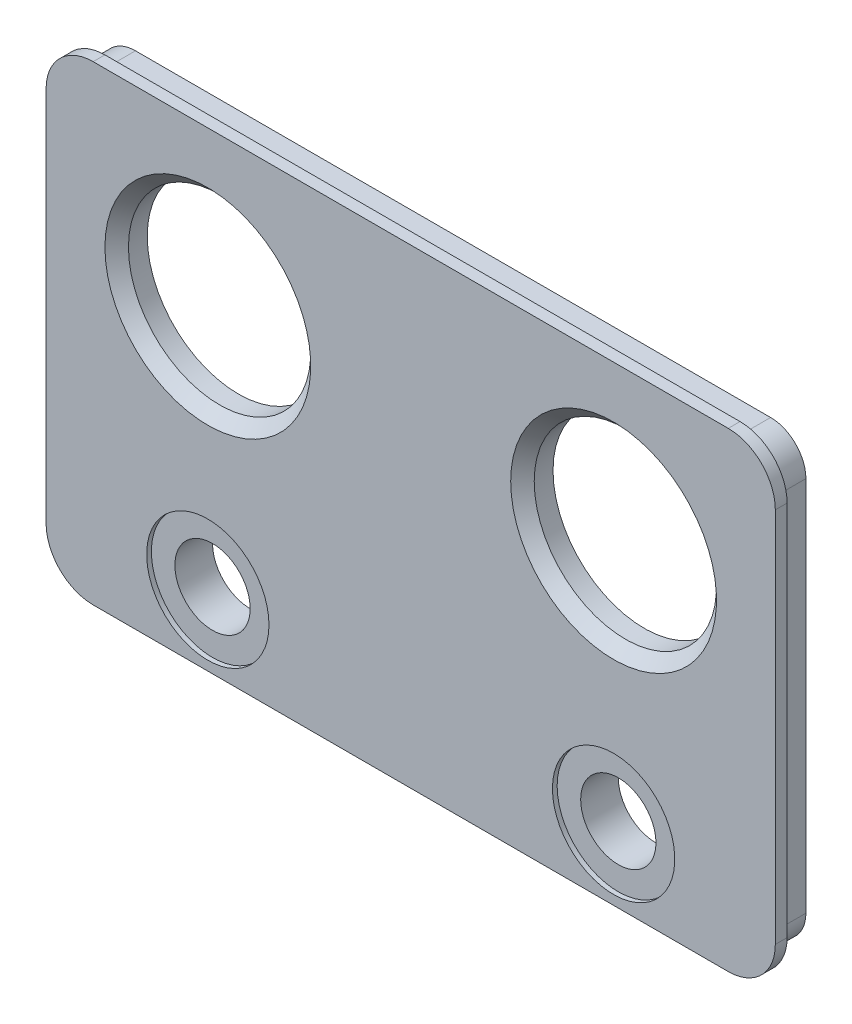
ISO-10303-21;
HEADER;
FILE_DESCRIPTION(('STEP AP214'),'2;1');
FILE_NAME('part.step','',(''),(''),'','','');
FILE_SCHEMA(('AUTOMOTIVE_DESIGN { 1 0 10303 214 1 1 1 1 }'));
ENDSEC;
DATA;
#1=APPLICATION_CONTEXT('core data for automotive mechanical design processes');
#2=APPLICATION_PROTOCOL_DEFINITION('international standard','automotive_design',2000,#1);
#3=PRODUCT_CONTEXT('',#1,'mechanical');
#4=PRODUCT('Part','Part','',(#3));
#5=PRODUCT_RELATED_PRODUCT_CATEGORY('part','',(#4));
#6=PRODUCT_DEFINITION_FORMATION('','',#4);
#7=PRODUCT_DEFINITION_CONTEXT('part definition',#1,'design');
#8=PRODUCT_DEFINITION('design','',#6,#7);
#9=PRODUCT_DEFINITION_SHAPE('','',#8);
#10=(LENGTH_UNIT() NAMED_UNIT(*) SI_UNIT(.MILLI.,.METRE.));
#11=(NAMED_UNIT(*) PLANE_ANGLE_UNIT() SI_UNIT($,.RADIAN.));
#12=(NAMED_UNIT(*) SI_UNIT($,.STERADIAN.) SOLID_ANGLE_UNIT());
#13=UNCERTAINTY_MEASURE_WITH_UNIT(LENGTH_MEASURE(1.E-05),#10,'distance_accuracy_value','');
#14=(GEOMETRIC_REPRESENTATION_CONTEXT(3) GLOBAL_UNCERTAINTY_ASSIGNED_CONTEXT((#13)) GLOBAL_UNIT_ASSIGNED_CONTEXT((#10,
#11,#12)) REPRESENTATION_CONTEXT('',''));
#15=CARTESIAN_POINT('',(0.,0.,0.));
#16=DIRECTION('',(0.,0.,1.));
#17=DIRECTION('',(1.,0.,0.));
#18=AXIS2_PLACEMENT_3D('',#15,#16,#17);
#19=CARTESIAN_POINT('',(135.,80.0000000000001,0.));
#20=DIRECTION('',(0.,0.,-1.));
#21=DIRECTION('',(-1.,0.,0.));
#22=AXIS2_PLACEMENT_3D('',#19,#20,#21);
#23=PLANE('',#22);
#24=CARTESIAN_POINT('',(-86.25,-70.,0.));
#25=DIRECTION('',(0.,0.,1.));
#26=DIRECTION('',(1.,0.,0.));
#27=AXIS2_PLACEMENT_3D('',#24,#25,#26);
#28=CIRCLE('',#27,16.);
#29=CARTESIAN_POINT('',(-70.25,-70.,0.));
#30=VERTEX_POINT('',#29);
#31=EDGE_CURVE('E492',#30,#30,#28,.T.);
#32=ORIENTED_EDGE('',*,*,#31,.T.);
#33=EDGE_LOOP('',(#32));
#34=FACE_BOUND('',#33,.T.);
#35=CARTESIAN_POINT('',(86.25,-70.,0.));
#36=DIRECTION('',(0.,0.,1.));
#37=DIRECTION('',(-1.,0.,0.));
#38=AXIS2_PLACEMENT_3D('',#35,#36,#37);
#39=CIRCLE('',#38,16.);
#40=CARTESIAN_POINT('',(70.25,-70.,0.));
#41=VERTEX_POINT('',#40);
#42=EDGE_CURVE('E479',#41,#41,#39,.T.);
#43=ORIENTED_EDGE('',*,*,#42,.T.);
#44=EDGE_LOOP('',(#43));
#45=FACE_BOUND('',#44,.T.);
#46=CARTESIAN_POINT('',(-122.678438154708,70.6784381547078,0.));
#47=DIRECTION('',(0.,0.,-1.));
#48=DIRECTION('',(1.,0.,0.));
#49=AXIS2_PLACEMENT_3D('',#46,#47,#48);
#50=CIRCLE('',#49,4.99999999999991);
#51=CARTESIAN_POINT('',(-127.583228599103,71.6495358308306,0.));
#52=VERTEX_POINT('',#51);
#53=CARTESIAN_POINT('',(-123.64953583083,75.5832285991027,0.));
#54=VERTEX_POINT('',#53);
#55=EDGE_CURVE('E372',#52,#54,#50,.T.);
#56=ORIENTED_EDGE('',*,*,#55,.F.);
#57=CARTESIAN_POINT('',(61.3132032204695,34.25,0.));
#58=DIRECTION('',(0.,0.,-1.));
#59=DIRECTION('',(1.,0.,0.));
#60=AXIS2_PLACEMENT_3D('',#57,#58,#59);
#61=CIRCLE('',#60,192.56320322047);
#62=CARTESIAN_POINT('',(-127.583228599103,-3.14953583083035,0.));
#63=VERTEX_POINT('',#62);
#64=EDGE_CURVE('E426',#63,#52,#61,.T.);
#65=ORIENTED_EDGE('',*,*,#64,.F.);
#66=CARTESIAN_POINT('',(-122.678438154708,-2.17843815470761,0.));
#67=DIRECTION('',(0.,0.,-1.));
#68=DIRECTION('',(1.,0.,0.));
#69=AXIS2_PLACEMENT_3D('',#66,#67,#68);
#70=CIRCLE('',#69,4.99999999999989);
#71=CARTESIAN_POINT('',(-123.649535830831,-7.08322859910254,0.));
#72=VERTEX_POINT('',#71);
#73=EDGE_CURVE('E429',#72,#63,#70,.T.);
#74=ORIENTED_EDGE('',*,*,#73,.F.);
#75=CARTESIAN_POINT('',(-86.25,181.81320322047,0.));
#76=DIRECTION('',(0.,0.,-1.));
#77=DIRECTION('',(1.,0.,0.));
#78=AXIS2_PLACEMENT_3D('',#75,#76,#77);
#79=CIRCLE('',#78,192.56320322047);
#80=CARTESIAN_POINT('',(-48.8504641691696,-7.08322859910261,0.));
#81=VERTEX_POINT('',#80);
#82=EDGE_CURVE('E433',#81,#72,#79,.T.);
#83=ORIENTED_EDGE('',*,*,#82,.F.);
#84=CARTESIAN_POINT('',(-49.8215618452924,-2.17843815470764,0.));
#85=DIRECTION('',(0.,0.,-1.));
#86=DIRECTION('',(1.,0.,0.));
#87=AXIS2_PLACEMENT_3D('',#84,#85,#86);
#88=CIRCLE('',#87,4.99999999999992);
#89=CARTESIAN_POINT('',(-44.9167714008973,-3.1495358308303,0.));
#90=VERTEX_POINT('',#89);
#91=EDGE_CURVE('E436',#90,#81,#88,.T.);
#92=ORIENTED_EDGE('',*,*,#91,.F.);
#93=CARTESIAN_POINT('',(-233.81320322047,34.2500000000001,0.));
#94=DIRECTION('',(0.,0.,-1.));
#95=DIRECTION('',(-1.,0.,0.));
#96=AXIS2_PLACEMENT_3D('',#93,#94,#95);
#97=CIRCLE('',#96,192.56320322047);
#98=CARTESIAN_POINT('',(-44.9167714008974,71.6495358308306,0.));
#99=VERTEX_POINT('',#98);
#100=EDGE_CURVE('E439',#99,#90,#97,.T.);
#101=ORIENTED_EDGE('',*,*,#100,.F.);
#102=CARTESIAN_POINT('',(-49.8215618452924,70.6784381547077,0.));
#103=DIRECTION('',(0.,0.,-1.));
#104=DIRECTION('',(-1.,0.,0.));
#105=AXIS2_PLACEMENT_3D('',#102,#103,#104);
#106=CIRCLE('',#105,4.99999999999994);
#107=CARTESIAN_POINT('',(-48.8504641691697,75.5832285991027,0.));
#108=VERTEX_POINT('',#107);
#109=EDGE_CURVE('E442',#108,#99,#106,.T.);
#110=ORIENTED_EDGE('',*,*,#109,.F.);
#111=CARTESIAN_POINT('',(-86.2500000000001,-113.31320322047,0.));
#112=DIRECTION('',(0.,0.,-1.));
#113=DIRECTION('',(-1.,0.,0.));
#114=AXIS2_PLACEMENT_3D('',#111,#112,#113);
#115=CIRCLE('',#114,192.56320322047);
#116=EDGE_CURVE('E445',#54,#108,#115,.T.);
#117=ORIENTED_EDGE('',*,*,#116,.F.);
#118=EDGE_LOOP('',(#56,#65,#74,#83,#92,#101,#110,#117));
#119=FACE_BOUND('',#118,.T.);
#120=CARTESIAN_POINT('',(49.8215618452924,-2.17843815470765,0.));
#121=DIRECTION('',(0.,0.,-1.));
#122=DIRECTION('',(-1.,0.,0.));
#123=AXIS2_PLACEMENT_3D('',#120,#121,#122);
#124=CIRCLE('',#123,4.99999999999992);
#125=CARTESIAN_POINT('',(48.8504641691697,-7.08322859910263,0.));
#126=VERTEX_POINT('',#125);
#127=CARTESIAN_POINT('',(44.9167714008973,-3.14953583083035,0.));
#128=VERTEX_POINT('',#127);
#129=EDGE_CURVE('E369',#126,#128,#124,.T.);
#130=ORIENTED_EDGE('',*,*,#129,.F.);
#131=CARTESIAN_POINT('',(86.25,181.81320322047,0.));
#132=DIRECTION('',(0.,0.,-1.));
#133=DIRECTION('',(-1.,0.,0.));
#134=AXIS2_PLACEMENT_3D('',#131,#132,#133);
#135=CIRCLE('',#134,192.56320322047);
#136=CARTESIAN_POINT('',(123.64953583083,-7.0832285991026,0.));
#137=VERTEX_POINT('',#136);
#138=EDGE_CURVE('E347',#137,#126,#135,.T.);
#139=ORIENTED_EDGE('',*,*,#138,.F.);
#140=CARTESIAN_POINT('',(122.678438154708,-2.17843815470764,0.));
#141=DIRECTION('',(0.,0.,-1.));
#142=DIRECTION('',(-1.,0.,0.));
#143=AXIS2_PLACEMENT_3D('',#140,#141,#142);
#144=CIRCLE('',#143,4.9999999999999);
#145=CARTESIAN_POINT('',(127.583228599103,-3.14953583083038,0.));
#146=VERTEX_POINT('',#145);
#147=EDGE_CURVE('E387',#146,#137,#144,.T.);
#148=ORIENTED_EDGE('',*,*,#147,.F.);
#149=CARTESIAN_POINT('',(-61.3132032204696,34.25,0.));
#150=DIRECTION('',(0.,0.,-1.));
#151=DIRECTION('',(-1.,0.,0.));
#152=AXIS2_PLACEMENT_3D('',#149,#150,#151);
#153=CIRCLE('',#152,192.56320322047);
#154=CARTESIAN_POINT('',(127.583228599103,71.6495358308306,0.));
#155=VERTEX_POINT('',#154);
#156=EDGE_CURVE('E384',#155,#146,#153,.T.);
#157=ORIENTED_EDGE('',*,*,#156,.F.);
#158=CARTESIAN_POINT('',(122.678438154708,70.6784381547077,0.));
#159=DIRECTION('',(0.,0.,-1.));
#160=DIRECTION('',(-1.,0.,0.));
#161=AXIS2_PLACEMENT_3D('',#158,#159,#160);
#162=CIRCLE('',#161,4.99999999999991);
#163=CARTESIAN_POINT('',(123.64953583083,75.5832285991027,0.));
#164=VERTEX_POINT('',#163);
#165=EDGE_CURVE('E381',#164,#155,#162,.T.);
#166=ORIENTED_EDGE('',*,*,#165,.F.);
#167=CARTESIAN_POINT('',(86.2500000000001,-113.31320322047,0.));
#168=DIRECTION('',(0.,0.,-1.));
#169=DIRECTION('',(1.,0.,0.));
#170=AXIS2_PLACEMENT_3D('',#167,#168,#169);
#171=CIRCLE('',#170,192.56320322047);
#172=CARTESIAN_POINT('',(48.8504641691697,75.5832285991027,0.));
#173=VERTEX_POINT('',#172);
#174=EDGE_CURVE('E378',#173,#164,#171,.T.);
#175=ORIENTED_EDGE('',*,*,#174,.F.);
#176=CARTESIAN_POINT('',(49.8215618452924,70.6784381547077,0.));
#177=DIRECTION('',(0.,0.,-1.));
#178=DIRECTION('',(1.,0.,0.));
#179=AXIS2_PLACEMENT_3D('',#176,#177,#178);
#180=CIRCLE('',#179,4.99999999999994);
#181=CARTESIAN_POINT('',(44.9167714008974,71.6495358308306,0.));
#182=VERTEX_POINT('',#181);
#183=EDGE_CURVE('E375',#182,#173,#180,.T.);
#184=ORIENTED_EDGE('',*,*,#183,.F.);
#185=CARTESIAN_POINT('',(233.81320322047,34.25,0.));
#186=DIRECTION('',(0.,0.,-1.));
#187=DIRECTION('',(1.,0.,0.));
#188=AXIS2_PLACEMENT_3D('',#185,#186,#187);
#189=CIRCLE('',#188,192.56320322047);
#190=EDGE_CURVE('E371',#128,#182,#189,.T.);
#191=ORIENTED_EDGE('',*,*,#190,.F.);
#192=EDGE_LOOP('',(#130,#139,#148,#157,#166,#175,#184,#191));
#193=FACE_BOUND('',#192,.T.);
#194=DIRECTION('',(1.,0.,0.));
#195=VECTOR('',#194,1.);
#196=CARTESIAN_POINT('',(-135.,95.,0.));
#197=LINE('',#196,#195);
#198=CARTESIAN_POINT('',(-135.,95.,0.));
#199=VERTEX_POINT('',#198);
#200=CARTESIAN_POINT('',(135.,95.0000000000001,0.));
#201=VERTEX_POINT('',#200);
#202=EDGE_CURVE('E280',#199,#201,#197,.T.);
#203=ORIENTED_EDGE('',*,*,#202,.T.);
#204=CARTESIAN_POINT('',(135.,80.0000000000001,0.));
#205=DIRECTION('',(0.,0.,-1.));
#206=DIRECTION('',(-1.,0.,0.));
#207=AXIS2_PLACEMENT_3D('',#204,#205,#206);
#208=CIRCLE('',#207,15.);
#209=CARTESIAN_POINT('',(150.,80.0000000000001,0.));
#210=VERTEX_POINT('',#209);
#211=EDGE_CURVE('E300',#201,#210,#208,.T.);
#212=ORIENTED_EDGE('',*,*,#211,.T.);
#213=DIRECTION('',(0.,-1.,0.));
#214=VECTOR('',#213,1.);
#215=CARTESIAN_POINT('',(150.,80.0000000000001,0.));
#216=LINE('',#215,#214);
#217=CARTESIAN_POINT('',(150.,-79.9999999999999,0.));
#218=VERTEX_POINT('',#217);
#219=EDGE_CURVE('E260',#210,#218,#216,.T.);
#220=ORIENTED_EDGE('',*,*,#219,.T.);
#221=CARTESIAN_POINT('',(135.,-79.9999999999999,0.));
#222=DIRECTION('',(0.,0.,-1.));
#223=DIRECTION('',(-1.,0.,0.));
#224=AXIS2_PLACEMENT_3D('',#221,#222,#223);
#225=CIRCLE('',#224,15.);
#226=CARTESIAN_POINT('',(135.,-94.9999999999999,0.));
#227=VERTEX_POINT('',#226);
#228=EDGE_CURVE('E60',#218,#227,#225,.T.);
#229=ORIENTED_EDGE('',*,*,#228,.T.);
#230=DIRECTION('',(-1.,0.,0.));
#231=VECTOR('',#230,1.);
#232=CARTESIAN_POINT('',(135.,-94.9999999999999,0.));
#233=LINE('',#232,#231);
#234=CARTESIAN_POINT('',(-135.,-94.9999999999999,0.));
#235=VERTEX_POINT('',#234);
#236=EDGE_CURVE('E304',#227,#235,#233,.T.);
#237=ORIENTED_EDGE('',*,*,#236,.T.);
#238=CARTESIAN_POINT('',(-135.,-80.,0.));
#239=DIRECTION('',(0.,0.,-1.));
#240=DIRECTION('',(-1.,0.,0.));
#241=AXIS2_PLACEMENT_3D('',#238,#239,#240);
#242=CIRCLE('',#241,15.);
#243=CARTESIAN_POINT('',(-150.,-80.,0.));
#244=VERTEX_POINT('',#243);
#245=EDGE_CURVE('E307',#235,#244,#242,.T.);
#246=ORIENTED_EDGE('',*,*,#245,.T.);
#247=DIRECTION('',(0.,1.,0.));
#248=VECTOR('',#247,1.);
#249=CARTESIAN_POINT('',(-150.,-80.,0.));
#250=LINE('',#249,#248);
#251=CARTESIAN_POINT('',(-150.,80.,0.));
#252=VERTEX_POINT('',#251);
#253=EDGE_CURVE('E310',#244,#252,#250,.T.);
#254=ORIENTED_EDGE('',*,*,#253,.T.);
#255=CARTESIAN_POINT('',(-135.,80.,0.));
#256=DIRECTION('',(0.,0.,-1.));
#257=DIRECTION('',(-1.,0.,0.));
#258=AXIS2_PLACEMENT_3D('',#255,#256,#257);
#259=CIRCLE('',#258,15.);
#260=EDGE_CURVE('E283',#252,#199,#259,.T.);
#261=ORIENTED_EDGE('',*,*,#260,.T.);
#262=EDGE_LOOP('',(#203,#212,#220,#229,#237,#246,#254,#261));
#263=FACE_BOUND('',#262,.T.);
#264=ADVANCED_FACE('F42',(#34,#45,#119,#193,#263),#23,.T.);
#265=CARTESIAN_POINT('',(135.,80.0000000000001,18.));
#266=DIRECTION('',(0.,0.,-1.));
#267=DIRECTION('',(-1.,0.,0.));
#268=AXIS2_PLACEMENT_3D('',#265,#266,#267);
#269=CYLINDRICAL_SURFACE('',#268,20.);
#270=CARTESIAN_POINT('',(135.,80.0000000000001,13.));
#271=DIRECTION('',(0.,0.,-1.));
#272=DIRECTION('',(-1.,0.,0.));
#273=AXIS2_PLACEMENT_3D('',#270,#271,#272);
#274=CIRCLE('',#273,20.);
#275=CARTESIAN_POINT('',(135.,100.,13.));
#276=VERTEX_POINT('',#275);
#277=CARTESIAN_POINT('',(155.,80.0000000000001,13.));
#278=VERTEX_POINT('',#277);
#279=EDGE_CURVE('E68',#276,#278,#274,.T.);
#280=ORIENTED_EDGE('',*,*,#279,.F.);
#281=DIRECTION('',(0.,0.,-1.));
#282=VECTOR('',#281,1.);
#283=CARTESIAN_POINT('',(135.,100.,18.));
#284=LINE('',#283,#282);
#285=CARTESIAN_POINT('',(135.,100.,18.));
#286=VERTEX_POINT('',#285);
#287=EDGE_CURVE('E533',#286,#276,#284,.T.);
#288=ORIENTED_EDGE('',*,*,#287,.F.);
#289=CARTESIAN_POINT('',(135.,80.0000000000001,18.));
#290=DIRECTION('',(0.,0.,1.));
#291=DIRECTION('',(-1.,0.,0.));
#292=AXIS2_PLACEMENT_3D('',#289,#290,#291);
#293=CIRCLE('',#292,20.);
#294=CARTESIAN_POINT('',(155.,80.0000000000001,18.));
#295=VERTEX_POINT('',#294);
#296=EDGE_CURVE('E495',#295,#286,#293,.T.);
#297=ORIENTED_EDGE('',*,*,#296,.F.);
#298=DIRECTION('',(0.,0.,-1.));
#299=VECTOR('',#298,1.);
#300=CARTESIAN_POINT('',(155.,80.0000000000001,18.));
#301=LINE('',#300,#299);
#302=EDGE_CURVE('E512',#295,#278,#301,.T.);
#303=ORIENTED_EDGE('',*,*,#302,.T.);
#304=EDGE_LOOP('',(#280,#288,#297,#303));
#305=FACE_BOUND('',#304,.T.);
#306=ADVANCED_FACE('F575',(#305),#269,.T.);
#307=CARTESIAN_POINT('',(-135.,100.,18.));
#308=DIRECTION('',(0.,-1.,0.));
#309=DIRECTION('',(1.,0.,0.));
#310=AXIS2_PLACEMENT_3D('',#307,#308,#309);
#311=PLANE('',#310);
#312=DIRECTION('',(1.,0.,0.));
#313=VECTOR('',#312,1.);
#314=CARTESIAN_POINT('',(-135.,100.,13.));
#315=LINE('',#314,#313);
#316=CARTESIAN_POINT('',(-135.,100.,13.));
#317=VERTEX_POINT('',#316);
#318=EDGE_CURVE('E340',#317,#276,#315,.T.);
#319=ORIENTED_EDGE('',*,*,#318,.F.);
#320=DIRECTION('',(0.,0.,-1.));
#321=VECTOR('',#320,1.);
#322=CARTESIAN_POINT('',(-135.,100.,18.));
#323=LINE('',#322,#321);
#324=CARTESIAN_POINT('',(-135.,100.,18.));
#325=VERTEX_POINT('',#324);
#326=EDGE_CURVE('E530',#325,#317,#323,.T.);
#327=ORIENTED_EDGE('',*,*,#326,.F.);
#328=DIRECTION('',(-1.,0.,0.));
#329=VECTOR('',#328,1.);
#330=CARTESIAN_POINT('',(-135.,100.,18.));
#331=LINE('',#330,#329);
#332=EDGE_CURVE('E498',#286,#325,#331,.T.);
#333=ORIENTED_EDGE('',*,*,#332,.F.);
#334=ORIENTED_EDGE('',*,*,#287,.T.);
#335=EDGE_LOOP('',(#319,#327,#333,#334));
#336=FACE_BOUND('',#335,.T.);
#337=ADVANCED_FACE('F581',(#336),#311,.F.);
#338=CARTESIAN_POINT('',(-135.,80.,18.));
#339=DIRECTION('',(0.,0.,-1.));
#340=DIRECTION('',(-1.,0.,0.));
#341=AXIS2_PLACEMENT_3D('',#338,#339,#340);
#342=CYLINDRICAL_SURFACE('',#341,20.);
#343=CARTESIAN_POINT('',(-135.,80.,13.));
#344=DIRECTION('',(0.,0.,-1.));
#345=DIRECTION('',(-1.,0.,0.));
#346=AXIS2_PLACEMENT_3D('',#343,#344,#345);
#347=CIRCLE('',#346,20.);
#348=CARTESIAN_POINT('',(-155.,80.,13.));
#349=VERTEX_POINT('',#348);
#350=EDGE_CURVE('E338',#349,#317,#347,.T.);
#351=ORIENTED_EDGE('',*,*,#350,.F.);
#352=DIRECTION('',(0.,0.,-1.));
#353=VECTOR('',#352,1.);
#354=CARTESIAN_POINT('',(-155.,80.,18.));
#355=LINE('',#354,#353);
#356=CARTESIAN_POINT('',(-155.,80.,18.));
#357=VERTEX_POINT('',#356);
#358=EDGE_CURVE('E527',#357,#349,#355,.T.);
#359=ORIENTED_EDGE('',*,*,#358,.F.);
#360=CARTESIAN_POINT('',(-135.,80.,18.));
#361=DIRECTION('',(0.,0.,1.));
#362=DIRECTION('',(-1.,0.,0.));
#363=AXIS2_PLACEMENT_3D('',#360,#361,#362);
#364=CIRCLE('',#363,20.);
#365=EDGE_CURVE('E500',#325,#357,#364,.T.);
#366=ORIENTED_EDGE('',*,*,#365,.F.);
#367=ORIENTED_EDGE('',*,*,#326,.T.);
#368=EDGE_LOOP('',(#351,#359,#366,#367));
#369=FACE_BOUND('',#368,.T.);
#370=ADVANCED_FACE('F608',(#369),#342,.T.);
#371=CARTESIAN_POINT('',(-155.,-80.,18.));
#372=DIRECTION('',(1.,0.,0.));
#373=DIRECTION('',(0.,1.,0.));
#374=AXIS2_PLACEMENT_3D('',#371,#372,#373);
#375=PLANE('',#374);
#376=DIRECTION('',(0.,1.,0.));
#377=VECTOR('',#376,1.);
#378=CARTESIAN_POINT('',(-155.,-80.,13.));
#379=LINE('',#378,#377);
#380=CARTESIAN_POINT('',(-155.,-80.,13.));
#381=VERTEX_POINT('',#380);
#382=EDGE_CURVE('E336',#381,#349,#379,.T.);
#383=ORIENTED_EDGE('',*,*,#382,.F.);
#384=DIRECTION('',(0.,0.,-1.));
#385=VECTOR('',#384,1.);
#386=CARTESIAN_POINT('',(-155.,-80.,18.));
#387=LINE('',#386,#385);
#388=CARTESIAN_POINT('',(-155.,-80.,18.));
#389=VERTEX_POINT('',#388);
#390=EDGE_CURVE('E524',#389,#381,#387,.T.);
#391=ORIENTED_EDGE('',*,*,#390,.F.);
#392=DIRECTION('',(0.,-1.,0.));
#393=VECTOR('',#392,1.);
#394=CARTESIAN_POINT('',(-155.,-80.,18.));
#395=LINE('',#394,#393);
#396=EDGE_CURVE('E502',#357,#389,#395,.T.);
#397=ORIENTED_EDGE('',*,*,#396,.F.);
#398=ORIENTED_EDGE('',*,*,#358,.T.);
#399=EDGE_LOOP('',(#383,#391,#397,#398));
#400=FACE_BOUND('',#399,.T.);
#401=ADVANCED_FACE('F604',(#400),#375,.F.);
#402=CARTESIAN_POINT('',(-135.,-80.,18.));
#403=DIRECTION('',(0.,0.,-1.));
#404=DIRECTION('',(-1.,0.,0.));
#405=AXIS2_PLACEMENT_3D('',#402,#403,#404);
#406=CYLINDRICAL_SURFACE('',#405,20.);
#407=CARTESIAN_POINT('',(-135.,-80.,13.));
#408=DIRECTION('',(0.,0.,-1.));
#409=DIRECTION('',(-1.,0.,0.));
#410=AXIS2_PLACEMENT_3D('',#407,#408,#409);
#411=CIRCLE('',#410,20.);
#412=CARTESIAN_POINT('',(-135.,-99.9999999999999,13.));
#413=VERTEX_POINT('',#412);
#414=EDGE_CURVE('E334',#413,#381,#411,.T.);
#415=ORIENTED_EDGE('',*,*,#414,.F.);
#416=DIRECTION('',(0.,0.,-1.));
#417=VECTOR('',#416,1.);
#418=CARTESIAN_POINT('',(-135.,-99.9999999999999,18.));
#419=LINE('',#418,#417);
#420=CARTESIAN_POINT('',(-135.,-99.9999999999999,18.));
#421=VERTEX_POINT('',#420);
#422=EDGE_CURVE('E521',#421,#413,#419,.T.);
#423=ORIENTED_EDGE('',*,*,#422,.F.);
#424=CARTESIAN_POINT('',(-135.,-80.,18.));
#425=DIRECTION('',(0.,0.,1.));
#426=DIRECTION('',(-1.,0.,0.));
#427=AXIS2_PLACEMENT_3D('',#424,#425,#426);
#428=CIRCLE('',#427,20.);
#429=EDGE_CURVE('E504',#389,#421,#428,.T.);
#430=ORIENTED_EDGE('',*,*,#429,.F.);
#431=ORIENTED_EDGE('',*,*,#390,.T.);
#432=EDGE_LOOP('',(#415,#423,#430,#431));
#433=FACE_BOUND('',#432,.T.);
#434=ADVANCED_FACE('F600',(#433),#406,.T.);
#435=CARTESIAN_POINT('',(-135.,-100.,18.));
#436=DIRECTION('',(0.,1.,0.));
#437=DIRECTION('',(-1.,0.,0.));
#438=AXIS2_PLACEMENT_3D('',#435,#436,#437);
#439=PLANE('',#438);
#440=DIRECTION('',(-1.,0.,0.));
#441=VECTOR('',#440,1.);
#442=CARTESIAN_POINT('',(135.,-99.9999999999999,13.));
#443=LINE('',#442,#441);
#444=CARTESIAN_POINT('',(135.,-99.9999999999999,13.));
#445=VERTEX_POINT('',#444);
#446=EDGE_CURVE('E332',#445,#413,#443,.T.);
#447=ORIENTED_EDGE('',*,*,#446,.F.);
#448=DIRECTION('',(0.,0.,-1.));
#449=VECTOR('',#448,1.);
#450=CARTESIAN_POINT('',(135.,-99.9999999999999,18.));
#451=LINE('',#450,#449);
#452=CARTESIAN_POINT('',(135.,-99.9999999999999,18.));
#453=VERTEX_POINT('',#452);
#454=EDGE_CURVE('E518',#453,#445,#451,.T.);
#455=ORIENTED_EDGE('',*,*,#454,.F.);
#456=DIRECTION('',(1.,0.,0.));
#457=VECTOR('',#456,1.);
#458=CARTESIAN_POINT('',(-135.,-100.,18.));
#459=LINE('',#458,#457);
#460=EDGE_CURVE('E506',#421,#453,#459,.T.);
#461=ORIENTED_EDGE('',*,*,#460,.F.);
#462=ORIENTED_EDGE('',*,*,#422,.T.);
#463=EDGE_LOOP('',(#447,#455,#461,#462));
#464=FACE_BOUND('',#463,.T.);
#465=ADVANCED_FACE('F596',(#464),#439,.F.);
#466=CARTESIAN_POINT('',(135.,-79.9999999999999,18.));
#467=DIRECTION('',(0.,0.,-1.));
#468=DIRECTION('',(-1.,0.,0.));
#469=AXIS2_PLACEMENT_3D('',#466,#467,#468);
#470=CYLINDRICAL_SURFACE('',#469,20.);
#471=CARTESIAN_POINT('',(135.,-79.9999999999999,13.));
#472=DIRECTION('',(0.,0.,-1.));
#473=DIRECTION('',(-1.,0.,0.));
#474=AXIS2_PLACEMENT_3D('',#471,#472,#473);
#475=CIRCLE('',#474,20.);
#476=CARTESIAN_POINT('',(155.,-79.9999999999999,13.));
#477=VERTEX_POINT('',#476);
#478=EDGE_CURVE('E330',#477,#445,#475,.T.);
#479=ORIENTED_EDGE('',*,*,#478,.F.);
#480=DIRECTION('',(0.,0.,-1.));
#481=VECTOR('',#480,1.);
#482=CARTESIAN_POINT('',(155.,-79.9999999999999,18.));
#483=LINE('',#482,#481);
#484=CARTESIAN_POINT('',(155.,-79.9999999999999,18.));
#485=VERTEX_POINT('',#484);
#486=EDGE_CURVE('E515',#485,#477,#483,.T.);
#487=ORIENTED_EDGE('',*,*,#486,.F.);
#488=CARTESIAN_POINT('',(135.,-79.9999999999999,18.));
#489=DIRECTION('',(0.,0.,1.));
#490=DIRECTION('',(1.,0.,0.));
#491=AXIS2_PLACEMENT_3D('',#488,#489,#490);
#492=CIRCLE('',#491,20.);
#493=EDGE_CURVE('E508',#453,#485,#492,.T.);
#494=ORIENTED_EDGE('',*,*,#493,.F.);
#495=ORIENTED_EDGE('',*,*,#454,.T.);
#496=EDGE_LOOP('',(#479,#487,#494,#495));
#497=FACE_BOUND('',#496,.T.);
#498=ADVANCED_FACE('F592',(#497),#470,.T.);
#499=CARTESIAN_POINT('',(155.,-79.9999999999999,18.));
#500=DIRECTION('',(-1.,0.,0.));
#501=DIRECTION('',(0.,0.,1.));
#502=AXIS2_PLACEMENT_3D('',#499,#500,#501);
#503=PLANE('',#502);
#504=DIRECTION('',(0.,-1.,0.));
#505=VECTOR('',#504,1.);
#506=CARTESIAN_POINT('',(155.,80.0000000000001,13.));
#507=LINE('',#506,#505);
#508=EDGE_CURVE('E328',#278,#477,#507,.T.);
#509=ORIENTED_EDGE('',*,*,#508,.F.);
#510=ORIENTED_EDGE('',*,*,#302,.F.);
#511=DIRECTION('',(0.,1.,0.));
#512=VECTOR('',#511,1.);
#513=CARTESIAN_POINT('',(155.,-79.9999999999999,18.));
#514=LINE('',#513,#512);
#515=EDGE_CURVE('E510',#485,#295,#514,.T.);
#516=ORIENTED_EDGE('',*,*,#515,.F.);
#517=ORIENTED_EDGE('',*,*,#486,.T.);
#518=EDGE_LOOP('',(#509,#510,#516,#517));
#519=FACE_BOUND('',#518,.T.);
#520=ADVANCED_FACE('F588',(#519),#503,.F.);
#521=CARTESIAN_POINT('',(86.25,34.25,18.));
#522=DIRECTION('',(0.,0.,-1.));
#523=DIRECTION('',(-1.,0.,0.));
#524=AXIS2_PLACEMENT_3D('',#521,#522,#523);
#525=CYLINDRICAL_SURFACE('',#524,38.75);
#526=CARTESIAN_POINT('',(86.25,34.25,13.));
#527=DIRECTION('',(0.,0.,-1.));
#528=DIRECTION('',(-1.,0.,0.));
#529=AXIS2_PLACEMENT_3D('',#526,#527,#528);
#530=CIRCLE('',#529,38.75);
#531=CARTESIAN_POINT('',(47.5,34.25,13.));
#532=VERTEX_POINT('',#531);
#533=EDGE_CURVE('E536',#532,#532,#530,.F.);
#534=ORIENTED_EDGE('',*,*,#533,.T.);
#535=EDGE_LOOP('',(#534));
#536=FACE_BOUND('',#535,.T.);
#537=CARTESIAN_POINT('',(86.25,34.25,5.));
#538=DIRECTION('',(0.,0.,-1.));
#539=DIRECTION('',(-1.,0.,0.));
#540=AXIS2_PLACEMENT_3D('',#537,#538,#539);
#541=CIRCLE('',#540,38.75);
#542=CARTESIAN_POINT('',(47.5,34.25,5.));
#543=VERTEX_POINT('',#542);
#544=EDGE_CURVE('E394',#543,#543,#541,.T.);
#545=ORIENTED_EDGE('',*,*,#544,.T.);
#546=EDGE_LOOP('',(#545));
#547=FACE_BOUND('',#546,.T.);
#548=ADVANCED_FACE('F591',(#536,#547),#525,.F.);
#549=CARTESIAN_POINT('',(-86.25,-70.,18.));
#550=DIRECTION('',(0.,0.,-1.));
#551=DIRECTION('',(-1.,0.,0.));
#552=AXIS2_PLACEMENT_3D('',#549,#550,#551);
#553=CYLINDRICAL_SURFACE('',#552,16.);
#554=ORIENTED_EDGE('',*,*,#31,.F.);
#555=EDGE_LOOP('',(#554));
#556=FACE_BOUND('',#555,.T.);
#557=CARTESIAN_POINT('',(-86.25,-70.,16.));
#558=DIRECTION('',(0.,0.,1.));
#559=DIRECTION('',(1.,0.,0.));
#560=AXIS2_PLACEMENT_3D('',#557,#558,#559);
#561=CIRCLE('',#560,16.);
#562=CARTESIAN_POINT('',(-70.25,-70.,16.));
#563=VERTEX_POINT('',#562);
#564=EDGE_CURVE('E471',#563,#563,#561,.T.);
#565=ORIENTED_EDGE('',*,*,#564,.T.);
#566=EDGE_LOOP('',(#565));
#567=FACE_BOUND('',#566,.T.);
#568=ADVANCED_FACE('F735',(#556,#567),#553,.F.);
#569=CARTESIAN_POINT('',(135.,80.0000000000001,18.));
#570=DIRECTION('',(0.,0.,-1.));
#571=DIRECTION('',(-1.,0.,0.));
#572=AXIS2_PLACEMENT_3D('',#569,#570,#571);
#573=PLANE('',#572);
#574=CARTESIAN_POINT('',(86.25,34.25,18.));
#575=DIRECTION('',(0.,0.,-1.));
#576=DIRECTION('',(-1.,0.,0.));
#577=AXIS2_PLACEMENT_3D('',#574,#575,#576);
#578=CIRCLE('',#577,43.75);
#579=CARTESIAN_POINT('',(42.5,34.25,18.));
#580=VERTEX_POINT('',#579);
#581=EDGE_CURVE('E52',#580,#580,#578,.T.);
#582=ORIENTED_EDGE('',*,*,#581,.T.);
#583=EDGE_LOOP('',(#582));
#584=FACE_BOUND('',#583,.T.);
#585=CARTESIAN_POINT('',(-86.25,34.25,18.));
#586=DIRECTION('',(0.,0.,-1.));
#587=DIRECTION('',(-1.,0.,0.));
#588=AXIS2_PLACEMENT_3D('',#585,#586,#587);
#589=CIRCLE('',#588,43.75);
#590=CARTESIAN_POINT('',(-130.,34.25,18.));
#591=VERTEX_POINT('',#590);
#592=EDGE_CURVE('E539',#591,#591,#589,.T.);
#593=ORIENTED_EDGE('',*,*,#592,.T.);
#594=EDGE_LOOP('',(#593));
#595=FACE_BOUND('',#594,.T.);
#596=CARTESIAN_POINT('',(-86.25,-70.,18.));
#597=DIRECTION('',(0.,0.,1.));
#598=DIRECTION('',(1.,0.,0.));
#599=AXIS2_PLACEMENT_3D('',#596,#597,#598);
#600=CIRCLE('',#599,26.);
#601=CARTESIAN_POINT('',(-60.25,-70.,18.));
#602=VERTEX_POINT('',#601);
#603=EDGE_CURVE('E474',#602,#602,#600,.T.);
#604=ORIENTED_EDGE('',*,*,#603,.F.);
#605=EDGE_LOOP('',(#604));
#606=FACE_BOUND('',#605,.T.);
#607=CARTESIAN_POINT('',(86.25,-70.,18.));
#608=DIRECTION('',(0.,0.,1.));
#609=DIRECTION('',(-1.,0.,0.));
#610=AXIS2_PLACEMENT_3D('',#607,#608,#609);
#611=CIRCLE('',#610,26.);
#612=CARTESIAN_POINT('',(60.25,-70.,18.));
#613=VERTEX_POINT('',#612);
#614=EDGE_CURVE('E482',#613,#613,#611,.T.);
#615=ORIENTED_EDGE('',*,*,#614,.F.);
#616=EDGE_LOOP('',(#615));
#617=FACE_BOUND('',#616,.T.);
#618=ORIENTED_EDGE('',*,*,#296,.T.);
#619=ORIENTED_EDGE('',*,*,#332,.T.);
#620=ORIENTED_EDGE('',*,*,#365,.T.);
#621=ORIENTED_EDGE('',*,*,#396,.T.);
#622=ORIENTED_EDGE('',*,*,#429,.T.);
#623=ORIENTED_EDGE('',*,*,#460,.T.);
#624=ORIENTED_EDGE('',*,*,#493,.T.);
#625=ORIENTED_EDGE('',*,*,#515,.T.);
#626=EDGE_LOOP('',(#618,#619,#620,#621,#622,#623,#624,#625));
#627=FACE_BOUND('',#626,.T.);
#628=ADVANCED_FACE('F556',(#584,#595,#606,#617,#627),#573,.F.);
#629=CARTESIAN_POINT('',(-86.25,34.25,18.));
#630=DIRECTION('',(0.,0.,-1.));
#631=DIRECTION('',(-1.,0.,0.));
#632=AXIS2_PLACEMENT_3D('',#629,#630,#631);
#633=CYLINDRICAL_SURFACE('',#632,38.75);
#634=CARTESIAN_POINT('',(-86.25,34.25,5.));
#635=DIRECTION('',(0.,0.,1.));
#636=DIRECTION('',(1.,0.,0.));
#637=AXIS2_PLACEMENT_3D('',#634,#635,#636);
#638=CIRCLE('',#637,38.75);
#639=CARTESIAN_POINT('',(-47.5,34.25,5.));
#640=VERTEX_POINT('',#639);
#641=EDGE_CURVE('E47',#640,#640,#638,.T.);
#642=ORIENTED_EDGE('',*,*,#641,.F.);
#643=EDGE_LOOP('',(#642));
#644=FACE_BOUND('',#643,.T.);
#645=CARTESIAN_POINT('',(-86.25,34.25,13.));
#646=DIRECTION('',(0.,0.,-1.));
#647=DIRECTION('',(-1.,0.,0.));
#648=AXIS2_PLACEMENT_3D('',#645,#646,#647);
#649=CIRCLE('',#648,38.75);
#650=CARTESIAN_POINT('',(-125.,34.25,13.));
#651=VERTEX_POINT('',#650);
#652=EDGE_CURVE('E11',#651,#651,#649,.F.);
#653=ORIENTED_EDGE('',*,*,#652,.T.);
#654=EDGE_LOOP('',(#653));
#655=FACE_BOUND('',#654,.T.);
#656=ADVANCED_FACE('F552',(#644,#655),#633,.F.);
#657=CARTESIAN_POINT('',(86.25,-70.,18.));
#658=DIRECTION('',(0.,0.,-1.));
#659=DIRECTION('',(-1.,0.,0.));
#660=AXIS2_PLACEMENT_3D('',#657,#658,#659);
#661=CYLINDRICAL_SURFACE('',#660,16.);
#662=CARTESIAN_POINT('',(86.25,-70.,16.));
#663=DIRECTION('',(0.,0.,1.));
#664=DIRECTION('',(-1.,0.,0.));
#665=AXIS2_PLACEMENT_3D('',#662,#663,#664);
#666=CIRCLE('',#665,16.);
#667=CARTESIAN_POINT('',(70.25,-70.,16.));
#668=VERTEX_POINT('',#667);
#669=EDGE_CURVE('E475',#668,#668,#666,.T.);
#670=ORIENTED_EDGE('',*,*,#669,.T.);
#671=EDGE_LOOP('',(#670));
#672=FACE_BOUND('',#671,.T.);
#673=ORIENTED_EDGE('',*,*,#42,.F.);
#674=EDGE_LOOP('',(#673));
#675=FACE_BOUND('',#674,.T.);
#676=ADVANCED_FACE('F555',(#672,#675),#661,.F.);
#677=CARTESIAN_POINT('',(86.25,-70.,16.));
#678=DIRECTION('',(0.,0.,1.));
#679=DIRECTION('',(1.,0.,0.));
#680=AXIS2_PLACEMENT_3D('',#677,#678,#679);
#681=CYLINDRICAL_SURFACE('',#680,26.);
#682=CARTESIAN_POINT('',(86.25,-70.,16.));
#683=DIRECTION('',(0.,0.,1.));
#684=DIRECTION('',(-1.,0.,0.));
#685=AXIS2_PLACEMENT_3D('',#682,#683,#684);
#686=CIRCLE('',#685,26.);
#687=CARTESIAN_POINT('',(60.25,-70.,16.));
#688=VERTEX_POINT('',#687);
#689=EDGE_CURVE('E485',#688,#688,#686,.T.);
#690=ORIENTED_EDGE('',*,*,#689,.F.);
#691=EDGE_LOOP('',(#690));
#692=FACE_BOUND('',#691,.T.);
#693=ORIENTED_EDGE('',*,*,#614,.T.);
#694=EDGE_LOOP('',(#693));
#695=FACE_BOUND('',#694,.T.);
#696=ADVANCED_FACE('F726',(#692,#695),#681,.F.);
#697=CARTESIAN_POINT('',(86.25,-70.,16.));
#698=DIRECTION('',(0.,0.,-1.));
#699=DIRECTION('',(-1.,0.,0.));
#700=AXIS2_PLACEMENT_3D('',#697,#698,#699);
#701=PLANE('',#700);
#702=ORIENTED_EDGE('',*,*,#669,.F.);
#703=EDGE_LOOP('',(#702));
#704=FACE_BOUND('',#703,.T.);
#705=ORIENTED_EDGE('',*,*,#689,.T.);
#706=EDGE_LOOP('',(#705));
#707=FACE_BOUND('',#706,.T.);
#708=ADVANCED_FACE('F724',(#704,#707),#701,.F.);
#709=CARTESIAN_POINT('',(-86.25,-70.,16.));
#710=DIRECTION('',(0.,0.,1.));
#711=DIRECTION('',(1.,0.,0.));
#712=AXIS2_PLACEMENT_3D('',#709,#710,#711);
#713=CYLINDRICAL_SURFACE('',#712,26.);
#714=CARTESIAN_POINT('',(-86.25,-70.,16.));
#715=DIRECTION('',(0.,0.,1.));
#716=DIRECTION('',(1.,0.,0.));
#717=AXIS2_PLACEMENT_3D('',#714,#715,#716);
#718=CIRCLE('',#717,26.);
#719=CARTESIAN_POINT('',(-60.25,-70.,16.));
#720=VERTEX_POINT('',#719);
#721=EDGE_CURVE('E476',#720,#720,#718,.T.);
#722=ORIENTED_EDGE('',*,*,#721,.F.);
#723=EDGE_LOOP('',(#722));
#724=FACE_BOUND('',#723,.T.);
#725=ORIENTED_EDGE('',*,*,#603,.T.);
#726=EDGE_LOOP('',(#725));
#727=FACE_BOUND('',#726,.T.);
#728=ADVANCED_FACE('F720',(#724,#727),#713,.F.);
#729=CARTESIAN_POINT('',(-86.25,-70.,16.));
#730=DIRECTION('',(0.,0.,1.));
#731=DIRECTION('',(1.,0.,0.));
#732=AXIS2_PLACEMENT_3D('',#729,#730,#731);
#733=PLANE('',#732);
#734=ORIENTED_EDGE('',*,*,#564,.F.);
#735=EDGE_LOOP('',(#734));
#736=FACE_BOUND('',#735,.T.);
#737=ORIENTED_EDGE('',*,*,#721,.T.);
#738=EDGE_LOOP('',(#737));
#739=FACE_BOUND('',#738,.T.);
#740=ADVANCED_FACE('F571',(#736,#739),#733,.T.);
#741=CARTESIAN_POINT('',(86.25,34.25,13.));
#742=DIRECTION('',(0.,0.,1.));
#743=DIRECTION('',(1.,0.,0.));
#744=AXIS2_PLACEMENT_3D('',#741,#742,#743);
#745=CONICAL_SURFACE('',#744,38.75,0.785398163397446);
#746=ORIENTED_EDGE('',*,*,#581,.F.);
#747=EDGE_LOOP('',(#746));
#748=FACE_BOUND('',#747,.T.);
#749=ORIENTED_EDGE('',*,*,#533,.F.);
#750=EDGE_LOOP('',(#749));
#751=FACE_BOUND('',#750,.T.);
#752=ADVANCED_FACE('F562',(#748,#751),#745,.F.);
#753=CARTESIAN_POINT('',(-86.25,34.25,13.));
#754=DIRECTION('',(0.,0.,1.));
#755=DIRECTION('',(1.,0.,0.));
#756=AXIS2_PLACEMENT_3D('',#753,#754,#755);
#757=CONICAL_SURFACE('',#756,38.75,0.785398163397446);
#758=ORIENTED_EDGE('',*,*,#592,.F.);
#759=EDGE_LOOP('',(#758));
#760=FACE_BOUND('',#759,.T.);
#761=ORIENTED_EDGE('',*,*,#652,.F.);
#762=EDGE_LOOP('',(#761));
#763=FACE_BOUND('',#762,.T.);
#764=ADVANCED_FACE('F45',(#760,#763),#757,.F.);
#765=CARTESIAN_POINT('',(49.8215618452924,-2.17843815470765,5.));
#766=DIRECTION('',(0.,0.,-1.));
#767=DIRECTION('',(-1.,0.,0.));
#768=AXIS2_PLACEMENT_3D('',#765,#766,#767);
#769=CYLINDRICAL_SURFACE('',#768,4.99999999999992);
#770=ORIENTED_EDGE('',*,*,#129,.T.);
#771=DIRECTION('',(0.,0.,-1.));
#772=VECTOR('',#771,1.);
#773=CARTESIAN_POINT('',(44.9167714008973,-3.14953583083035,5.));
#774=LINE('',#773,#772);
#775=CARTESIAN_POINT('',(44.9167714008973,-3.14953583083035,5.));
#776=VERTEX_POINT('',#775);
#777=EDGE_CURVE('E368',#776,#128,#774,.T.);
#778=ORIENTED_EDGE('',*,*,#777,.F.);
#779=CARTESIAN_POINT('',(49.8215618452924,-2.17843815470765,5.));
#780=DIRECTION('',(0.,0.,-1.));
#781=DIRECTION('',(-1.,0.,0.));
#782=AXIS2_PLACEMENT_3D('',#779,#780,#781);
#783=CIRCLE('',#782,4.99999999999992);
#784=CARTESIAN_POINT('',(48.8504641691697,-7.08322859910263,5.));
#785=VERTEX_POINT('',#784);
#786=EDGE_CURVE('E343',#785,#776,#783,.T.);
#787=ORIENTED_EDGE('',*,*,#786,.F.);
#788=DIRECTION('',(0.,0.,-1.));
#789=VECTOR('',#788,1.);
#790=CARTESIAN_POINT('',(48.8504641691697,-7.08322859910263,5.));
#791=LINE('',#790,#789);
#792=EDGE_CURVE('E392',#785,#126,#791,.T.);
#793=ORIENTED_EDGE('',*,*,#792,.T.);
#794=EDGE_LOOP('',(#770,#778,#787,#793));
#795=FACE_BOUND('',#794,.T.);
#796=ADVANCED_FACE('F561',(#795),#769,.F.);
#797=CARTESIAN_POINT('',(86.25,181.81320322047,5.));
#798=DIRECTION('',(0.,0.,-1.));
#799=DIRECTION('',(-1.,0.,0.));
#800=AXIS2_PLACEMENT_3D('',#797,#798,#799);
#801=CYLINDRICAL_SURFACE('',#800,192.56320322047);
#802=ORIENTED_EDGE('',*,*,#138,.T.);
#803=ORIENTED_EDGE('',*,*,#792,.F.);
#804=CARTESIAN_POINT('',(86.25,181.81320322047,5.));
#805=DIRECTION('',(0.,0.,-1.));
#806=DIRECTION('',(-1.,0.,0.));
#807=AXIS2_PLACEMENT_3D('',#804,#805,#806);
#808=CIRCLE('',#807,192.56320322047);
#809=CARTESIAN_POINT('',(123.64953583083,-7.0832285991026,5.));
#810=VERTEX_POINT('',#809);
#811=EDGE_CURVE('E365',#810,#785,#808,.T.);
#812=ORIENTED_EDGE('',*,*,#811,.F.);
#813=DIRECTION('',(0.,0.,-1.));
#814=VECTOR('',#813,1.);
#815=CARTESIAN_POINT('',(123.64953583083,-7.0832285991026,5.));
#816=LINE('',#815,#814);
#817=EDGE_CURVE('E395',#810,#137,#816,.T.);
#818=ORIENTED_EDGE('',*,*,#817,.T.);
#819=EDGE_LOOP('',(#802,#803,#812,#818));
#820=FACE_BOUND('',#819,.T.);
#821=ADVANCED_FACE('F568',(#820),#801,.F.);
#822=CARTESIAN_POINT('',(122.678438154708,-2.17843815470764,5.));
#823=DIRECTION('',(0.,0.,-1.));
#824=DIRECTION('',(-1.,0.,0.));
#825=AXIS2_PLACEMENT_3D('',#822,#823,#824);
#826=CYLINDRICAL_SURFACE('',#825,4.9999999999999);
#827=ORIENTED_EDGE('',*,*,#147,.T.);
#828=ORIENTED_EDGE('',*,*,#817,.F.);
#829=CARTESIAN_POINT('',(122.678438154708,-2.17843815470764,5.));
#830=DIRECTION('',(0.,0.,-1.));
#831=DIRECTION('',(-1.,0.,0.));
#832=AXIS2_PLACEMENT_3D('',#829,#830,#831);
#833=CIRCLE('',#832,4.9999999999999);
#834=CARTESIAN_POINT('',(127.583228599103,-3.14953583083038,5.));
#835=VERTEX_POINT('',#834);
#836=EDGE_CURVE('E362',#835,#810,#833,.T.);
#837=ORIENTED_EDGE('',*,*,#836,.F.);
#838=DIRECTION('',(0.,0.,-1.));
#839=VECTOR('',#838,1.);
#840=CARTESIAN_POINT('',(127.583228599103,-3.14953583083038,5.));
#841=LINE('',#840,#839);
#842=EDGE_CURVE('E397',#835,#146,#841,.T.);
#843=ORIENTED_EDGE('',*,*,#842,.T.);
#844=EDGE_LOOP('',(#827,#828,#837,#843));
#845=FACE_BOUND('',#844,.T.);
#846=ADVANCED_FACE('F664',(#845),#826,.F.);
#847=CARTESIAN_POINT('',(-61.3132032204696,34.25,5.));
#848=DIRECTION('',(0.,0.,-1.));
#849=DIRECTION('',(-1.,0.,0.));
#850=AXIS2_PLACEMENT_3D('',#847,#848,#849);
#851=CYLINDRICAL_SURFACE('',#850,192.56320322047);
#852=ORIENTED_EDGE('',*,*,#156,.T.);
#853=ORIENTED_EDGE('',*,*,#842,.F.);
#854=CARTESIAN_POINT('',(-61.3132032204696,34.25,5.));
#855=DIRECTION('',(0.,0.,-1.));
#856=DIRECTION('',(-1.,0.,0.));
#857=AXIS2_PLACEMENT_3D('',#854,#855,#856);
#858=CIRCLE('',#857,192.56320322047);
#859=CARTESIAN_POINT('',(127.583228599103,71.6495358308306,5.));
#860=VERTEX_POINT('',#859);
#861=EDGE_CURVE('E359',#860,#835,#858,.T.);
#862=ORIENTED_EDGE('',*,*,#861,.F.);
#863=DIRECTION('',(0.,0.,-1.));
#864=VECTOR('',#863,1.);
#865=CARTESIAN_POINT('',(127.583228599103,71.6495358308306,5.));
#866=LINE('',#865,#864);
#867=EDGE_CURVE('E399',#860,#155,#866,.T.);
#868=ORIENTED_EDGE('',*,*,#867,.T.);
#869=EDGE_LOOP('',(#852,#853,#862,#868));
#870=FACE_BOUND('',#869,.T.);
#871=ADVANCED_FACE('F668',(#870),#851,.F.);
#872=CARTESIAN_POINT('',(122.678438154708,70.6784381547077,5.));
#873=DIRECTION('',(0.,0.,-1.));
#874=DIRECTION('',(-1.,0.,0.));
#875=AXIS2_PLACEMENT_3D('',#872,#873,#874);
#876=CYLINDRICAL_SURFACE('',#875,4.99999999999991);
#877=ORIENTED_EDGE('',*,*,#165,.T.);
#878=ORIENTED_EDGE('',*,*,#867,.F.);
#879=CARTESIAN_POINT('',(122.678438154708,70.6784381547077,5.));
#880=DIRECTION('',(0.,0.,-1.));
#881=DIRECTION('',(-1.,0.,0.));
#882=AXIS2_PLACEMENT_3D('',#879,#880,#881);
#883=CIRCLE('',#882,4.99999999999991);
#884=CARTESIAN_POINT('',(123.64953583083,75.5832285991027,5.));
#885=VERTEX_POINT('',#884);
#886=EDGE_CURVE('E356',#885,#860,#883,.T.);
#887=ORIENTED_EDGE('',*,*,#886,.F.);
#888=DIRECTION('',(0.,0.,-1.));
#889=VECTOR('',#888,1.);
#890=CARTESIAN_POINT('',(123.64953583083,75.5832285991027,5.));
#891=LINE('',#890,#889);
#892=EDGE_CURVE('E401',#885,#164,#891,.T.);
#893=ORIENTED_EDGE('',*,*,#892,.T.);
#894=EDGE_LOOP('',(#877,#878,#887,#893));
#895=FACE_BOUND('',#894,.T.);
#896=ADVANCED_FACE('F672',(#895),#876,.F.);
#897=CARTESIAN_POINT('',(86.2500000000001,-113.31320322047,5.));
#898=DIRECTION('',(0.,0.,-1.));
#899=DIRECTION('',(-1.,0.,0.));
#900=AXIS2_PLACEMENT_3D('',#897,#898,#899);
#901=CYLINDRICAL_SURFACE('',#900,192.56320322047);
#902=ORIENTED_EDGE('',*,*,#174,.T.);
#903=ORIENTED_EDGE('',*,*,#892,.F.);
#904=CARTESIAN_POINT('',(86.2500000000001,-113.31320322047,5.));
#905=DIRECTION('',(0.,0.,-1.));
#906=DIRECTION('',(1.,0.,0.));
#907=AXIS2_PLACEMENT_3D('',#904,#905,#906);
#908=CIRCLE('',#907,192.56320322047);
#909=CARTESIAN_POINT('',(48.8504641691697,75.5832285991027,5.));
#910=VERTEX_POINT('',#909);
#911=EDGE_CURVE('E353',#910,#885,#908,.T.);
#912=ORIENTED_EDGE('',*,*,#911,.F.);
#913=DIRECTION('',(0.,0.,-1.));
#914=VECTOR('',#913,1.);
#915=CARTESIAN_POINT('',(48.8504641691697,75.5832285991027,5.));
#916=LINE('',#915,#914);
#917=EDGE_CURVE('E403',#910,#173,#916,.T.);
#918=ORIENTED_EDGE('',*,*,#917,.T.);
#919=EDGE_LOOP('',(#902,#903,#912,#918));
#920=FACE_BOUND('',#919,.T.);
#921=ADVANCED_FACE('F676',(#920),#901,.F.);
#922=CARTESIAN_POINT('',(49.8215618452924,70.6784381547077,5.));
#923=DIRECTION('',(0.,0.,-1.));
#924=DIRECTION('',(-1.,0.,0.));
#925=AXIS2_PLACEMENT_3D('',#922,#923,#924);
#926=CYLINDRICAL_SURFACE('',#925,4.99999999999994);
#927=ORIENTED_EDGE('',*,*,#183,.T.);
#928=ORIENTED_EDGE('',*,*,#917,.F.);
#929=CARTESIAN_POINT('',(49.8215618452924,70.6784381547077,5.));
#930=DIRECTION('',(0.,0.,-1.));
#931=DIRECTION('',(1.,0.,0.));
#932=AXIS2_PLACEMENT_3D('',#929,#930,#931);
#933=CIRCLE('',#932,4.99999999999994);
#934=CARTESIAN_POINT('',(44.9167714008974,71.6495358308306,5.));
#935=VERTEX_POINT('',#934);
#936=EDGE_CURVE('E350',#935,#910,#933,.T.);
#937=ORIENTED_EDGE('',*,*,#936,.F.);
#938=DIRECTION('',(0.,0.,-1.));
#939=VECTOR('',#938,1.);
#940=CARTESIAN_POINT('',(44.9167714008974,71.6495358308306,5.));
#941=LINE('',#940,#939);
#942=EDGE_CURVE('E405',#935,#182,#941,.T.);
#943=ORIENTED_EDGE('',*,*,#942,.T.);
#944=EDGE_LOOP('',(#927,#928,#937,#943));
#945=FACE_BOUND('',#944,.T.);
#946=ADVANCED_FACE('F680',(#945),#926,.F.);
#947=CARTESIAN_POINT('',(233.81320322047,34.25,5.));
#948=DIRECTION('',(0.,0.,-1.));
#949=DIRECTION('',(-1.,0.,0.));
#950=AXIS2_PLACEMENT_3D('',#947,#948,#949);
#951=CYLINDRICAL_SURFACE('',#950,192.56320322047);
#952=ORIENTED_EDGE('',*,*,#190,.T.);
#953=ORIENTED_EDGE('',*,*,#942,.F.);
#954=CARTESIAN_POINT('',(233.81320322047,34.25,5.));
#955=DIRECTION('',(0.,0.,-1.));
#956=DIRECTION('',(1.,0.,0.));
#957=AXIS2_PLACEMENT_3D('',#954,#955,#956);
#958=CIRCLE('',#957,192.56320322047);
#959=EDGE_CURVE('E346',#776,#935,#958,.T.);
#960=ORIENTED_EDGE('',*,*,#959,.F.);
#961=ORIENTED_EDGE('',*,*,#777,.T.);
#962=EDGE_LOOP('',(#952,#953,#960,#961));
#963=FACE_BOUND('',#962,.T.);
#964=ADVANCED_FACE('F660',(#963),#951,.F.);
#965=CARTESIAN_POINT('',(141.817382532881,16.0357809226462,5.));
#966=DIRECTION('',(0.,0.,-1.));
#967=DIRECTION('',(-1.,0.,0.));
#968=AXIS2_PLACEMENT_3D('',#965,#966,#967);
#969=PLANE('',#968);
#970=ORIENTED_EDGE('',*,*,#544,.F.);
#971=EDGE_LOOP('',(#970));
#972=FACE_BOUND('',#971,.T.);
#973=ORIENTED_EDGE('',*,*,#786,.T.);
#974=ORIENTED_EDGE('',*,*,#959,.T.);
#975=ORIENTED_EDGE('',*,*,#936,.T.);
#976=ORIENTED_EDGE('',*,*,#911,.T.);
#977=ORIENTED_EDGE('',*,*,#886,.T.);
#978=ORIENTED_EDGE('',*,*,#861,.T.);
#979=ORIENTED_EDGE('',*,*,#836,.T.);
#980=ORIENTED_EDGE('',*,*,#811,.T.);
#981=EDGE_LOOP('',(#973,#974,#975,#976,#977,#978,#979,#980));
#982=FACE_BOUND('',#981,.T.);
#983=ADVANCED_FACE('F656',(#972,#982),#969,.T.);
#984=CARTESIAN_POINT('',(-122.678438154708,70.6784381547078,5.));
#985=DIRECTION('',(0.,0.,-1.));
#986=DIRECTION('',(-1.,0.,0.));
#987=AXIS2_PLACEMENT_3D('',#984,#985,#986);
#988=CYLINDRICAL_SURFACE('',#987,4.99999999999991);
#989=ORIENTED_EDGE('',*,*,#55,.T.);
#990=DIRECTION('',(0.,0.,-1.));
#991=VECTOR('',#990,1.);
#992=CARTESIAN_POINT('',(-123.64953583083,75.5832285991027,5.));
#993=LINE('',#992,#991);
#994=CARTESIAN_POINT('',(-123.64953583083,75.5832285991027,5.));
#995=VERTEX_POINT('',#994);
#996=EDGE_CURVE('E409',#995,#54,#993,.T.);
#997=ORIENTED_EDGE('',*,*,#996,.F.);
#998=CARTESIAN_POINT('',(-122.678438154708,70.6784381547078,5.));
#999=DIRECTION('',(0.,0.,-1.));
#1000=DIRECTION('',(1.,0.,0.));
#1001=AXIS2_PLACEMENT_3D('',#998,#999,#1000);
#1002=CIRCLE('',#1001,4.99999999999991);
#1003=CARTESIAN_POINT('',(-127.583228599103,71.6495358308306,5.));
#1004=VERTEX_POINT('',#1003);
#1005=EDGE_CURVE('E430',#1004,#995,#1002,.T.);
#1006=ORIENTED_EDGE('',*,*,#1005,.F.);
#1007=DIRECTION('',(0.,0.,-1.));
#1008=VECTOR('',#1007,1.);
#1009=CARTESIAN_POINT('',(-127.583228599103,71.6495358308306,5.));
#1010=LINE('',#1009,#1008);
#1011=EDGE_CURVE('E342',#1004,#52,#1010,.T.);
#1012=ORIENTED_EDGE('',*,*,#1011,.T.);
#1013=EDGE_LOOP('',(#989,#997,#1006,#1012));
#1014=FACE_BOUND('',#1013,.T.);
#1015=ADVANCED_FACE('F659',(#1014),#988,.F.);
#1016=CARTESIAN_POINT('',(61.3132032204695,34.25,5.));
#1017=DIRECTION('',(0.,0.,-1.));
#1018=DIRECTION('',(-1.,0.,0.));
#1019=AXIS2_PLACEMENT_3D('',#1016,#1017,#1018);
#1020=CYLINDRICAL_SURFACE('',#1019,192.56320322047);
#1021=ORIENTED_EDGE('',*,*,#64,.T.);
#1022=ORIENTED_EDGE('',*,*,#1011,.F.);
#1023=CARTESIAN_POINT('',(61.3132032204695,34.25,5.));
#1024=DIRECTION('',(0.,0.,-1.));
#1025=DIRECTION('',(1.,0.,0.));
#1026=AXIS2_PLACEMENT_3D('',#1023,#1024,#1025);
#1027=CIRCLE('',#1026,192.56320322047);
#1028=CARTESIAN_POINT('',(-127.583228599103,-3.14953583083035,5.));
#1029=VERTEX_POINT('',#1028);
#1030=EDGE_CURVE('E412',#1029,#1004,#1027,.T.);
#1031=ORIENTED_EDGE('',*,*,#1030,.F.);
#1032=DIRECTION('',(0.,0.,-1.));
#1033=VECTOR('',#1032,1.);
#1034=CARTESIAN_POINT('',(-127.583228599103,-3.14953583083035,5.));
#1035=LINE('',#1034,#1033);
#1036=EDGE_CURVE('E423',#1029,#63,#1035,.T.);
#1037=ORIENTED_EDGE('',*,*,#1036,.T.);
#1038=EDGE_LOOP('',(#1021,#1022,#1031,#1037));
#1039=FACE_BOUND('',#1038,.T.);
#1040=ADVANCED_FACE('F690',(#1039),#1020,.F.);
#1041=CARTESIAN_POINT('',(-122.678438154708,-2.17843815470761,5.));
#1042=DIRECTION('',(0.,0.,-1.));
#1043=DIRECTION('',(-1.,0.,0.));
#1044=AXIS2_PLACEMENT_3D('',#1041,#1042,#1043);
#1045=CYLINDRICAL_SURFACE('',#1044,4.99999999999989);
#1046=ORIENTED_EDGE('',*,*,#73,.T.);
#1047=ORIENTED_EDGE('',*,*,#1036,.F.);
#1048=CARTESIAN_POINT('',(-122.678438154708,-2.17843815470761,5.));
#1049=DIRECTION('',(0.,0.,-1.));
#1050=DIRECTION('',(1.,0.,0.));
#1051=AXIS2_PLACEMENT_3D('',#1048,#1049,#1050);
#1052=CIRCLE('',#1051,4.99999999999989);
#1053=CARTESIAN_POINT('',(-123.649535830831,-7.08322859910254,5.));
#1054=VERTEX_POINT('',#1053);
#1055=EDGE_CURVE('E451',#1054,#1029,#1052,.T.);
#1056=ORIENTED_EDGE('',*,*,#1055,.F.);
#1057=DIRECTION('',(0.,0.,-1.));
#1058=VECTOR('',#1057,1.);
#1059=CARTESIAN_POINT('',(-123.649535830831,-7.08322859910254,5.));
#1060=LINE('',#1059,#1058);
#1061=EDGE_CURVE('E421',#1054,#72,#1060,.T.);
#1062=ORIENTED_EDGE('',*,*,#1061,.T.);
#1063=EDGE_LOOP('',(#1046,#1047,#1056,#1062));
#1064=FACE_BOUND('',#1063,.T.);
#1065=ADVANCED_FACE('F710',(#1064),#1045,.F.);
#1066=CARTESIAN_POINT('',(-86.25,181.81320322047,5.));
#1067=DIRECTION('',(0.,0.,-1.));
#1068=DIRECTION('',(-1.,0.,0.));
#1069=AXIS2_PLACEMENT_3D('',#1066,#1067,#1068);
#1070=CYLINDRICAL_SURFACE('',#1069,192.56320322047);
#1071=ORIENTED_EDGE('',*,*,#82,.T.);
#1072=ORIENTED_EDGE('',*,*,#1061,.F.);
#1073=CARTESIAN_POINT('',(-86.25,181.81320322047,5.));
#1074=DIRECTION('',(0.,0.,-1.));
#1075=DIRECTION('',(1.,0.,0.));
#1076=AXIS2_PLACEMENT_3D('',#1073,#1074,#1075);
#1077=CIRCLE('',#1076,192.56320322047);
#1078=CARTESIAN_POINT('',(-48.8504641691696,-7.08322859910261,5.));
#1079=VERTEX_POINT('',#1078);
#1080=EDGE_CURVE('E454',#1079,#1054,#1077,.T.);
#1081=ORIENTED_EDGE('',*,*,#1080,.F.);
#1082=DIRECTION('',(0.,0.,-1.));
#1083=VECTOR('',#1082,1.);
#1084=CARTESIAN_POINT('',(-48.8504641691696,-7.08322859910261,5.));
#1085=LINE('',#1084,#1083);
#1086=EDGE_CURVE('E419',#1079,#81,#1085,.T.);
#1087=ORIENTED_EDGE('',*,*,#1086,.T.);
#1088=EDGE_LOOP('',(#1071,#1072,#1081,#1087));
#1089=FACE_BOUND('',#1088,.T.);
#1090=ADVANCED_FACE('F706',(#1089),#1070,.F.);
#1091=CARTESIAN_POINT('',(-49.8215618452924,-2.17843815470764,5.));
#1092=DIRECTION('',(0.,0.,-1.));
#1093=DIRECTION('',(-1.,0.,0.));
#1094=AXIS2_PLACEMENT_3D('',#1091,#1092,#1093);
#1095=CYLINDRICAL_SURFACE('',#1094,4.99999999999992);
#1096=ORIENTED_EDGE('',*,*,#91,.T.);
#1097=ORIENTED_EDGE('',*,*,#1086,.F.);
#1098=CARTESIAN_POINT('',(-49.8215618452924,-2.17843815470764,5.));
#1099=DIRECTION('',(0.,0.,-1.));
#1100=DIRECTION('',(1.,0.,0.));
#1101=AXIS2_PLACEMENT_3D('',#1098,#1099,#1100);
#1102=CIRCLE('',#1101,4.99999999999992);
#1103=CARTESIAN_POINT('',(-44.9167714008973,-3.1495358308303,5.));
#1104=VERTEX_POINT('',#1103);
#1105=EDGE_CURVE('E457',#1104,#1079,#1102,.T.);
#1106=ORIENTED_EDGE('',*,*,#1105,.F.);
#1107=DIRECTION('',(0.,0.,-1.));
#1108=VECTOR('',#1107,1.);
#1109=CARTESIAN_POINT('',(-44.9167714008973,-3.1495358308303,5.));
#1110=LINE('',#1109,#1108);
#1111=EDGE_CURVE('E417',#1104,#90,#1110,.T.);
#1112=ORIENTED_EDGE('',*,*,#1111,.T.);
#1113=EDGE_LOOP('',(#1096,#1097,#1106,#1112));
#1114=FACE_BOUND('',#1113,.T.);
#1115=ADVANCED_FACE('F702',(#1114),#1095,.F.);
#1116=CARTESIAN_POINT('',(-233.81320322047,34.2500000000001,5.));
#1117=DIRECTION('',(0.,0.,-1.));
#1118=DIRECTION('',(-1.,0.,0.));
#1119=AXIS2_PLACEMENT_3D('',#1116,#1117,#1118);
#1120=CYLINDRICAL_SURFACE('',#1119,192.56320322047);
#1121=ORIENTED_EDGE('',*,*,#100,.T.);
#1122=ORIENTED_EDGE('',*,*,#1111,.F.);
#1123=CARTESIAN_POINT('',(-233.81320322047,34.2500000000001,5.));
#1124=DIRECTION('',(0.,0.,-1.));
#1125=DIRECTION('',(-1.,0.,0.));
#1126=AXIS2_PLACEMENT_3D('',#1123,#1124,#1125);
#1127=CIRCLE('',#1126,192.56320322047);
#1128=CARTESIAN_POINT('',(-44.9167714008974,71.6495358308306,5.));
#1129=VERTEX_POINT('',#1128);
#1130=EDGE_CURVE('E460',#1129,#1104,#1127,.T.);
#1131=ORIENTED_EDGE('',*,*,#1130,.F.);
#1132=DIRECTION('',(0.,0.,-1.));
#1133=VECTOR('',#1132,1.);
#1134=CARTESIAN_POINT('',(-44.9167714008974,71.6495358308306,5.));
#1135=LINE('',#1134,#1133);
#1136=EDGE_CURVE('E415',#1129,#99,#1135,.T.);
#1137=ORIENTED_EDGE('',*,*,#1136,.T.);
#1138=EDGE_LOOP('',(#1121,#1122,#1131,#1137));
#1139=FACE_BOUND('',#1138,.T.);
#1140=ADVANCED_FACE('F698',(#1139),#1120,.F.);
#1141=CARTESIAN_POINT('',(-49.8215618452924,70.6784381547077,5.));
#1142=DIRECTION('',(0.,0.,-1.));
#1143=DIRECTION('',(-1.,0.,0.));
#1144=AXIS2_PLACEMENT_3D('',#1141,#1142,#1143);
#1145=CYLINDRICAL_SURFACE('',#1144,4.99999999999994);
#1146=ORIENTED_EDGE('',*,*,#109,.T.);
#1147=ORIENTED_EDGE('',*,*,#1136,.F.);
#1148=CARTESIAN_POINT('',(-49.8215618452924,70.6784381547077,5.));
#1149=DIRECTION('',(0.,0.,-1.));
#1150=DIRECTION('',(-1.,0.,0.));
#1151=AXIS2_PLACEMENT_3D('',#1148,#1149,#1150);
#1152=CIRCLE('',#1151,4.99999999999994);
#1153=CARTESIAN_POINT('',(-48.8504641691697,75.5832285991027,5.));
#1154=VERTEX_POINT('',#1153);
#1155=EDGE_CURVE('E463',#1154,#1129,#1152,.T.);
#1156=ORIENTED_EDGE('',*,*,#1155,.F.);
#1157=DIRECTION('',(0.,0.,-1.));
#1158=VECTOR('',#1157,1.);
#1159=CARTESIAN_POINT('',(-48.8504641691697,75.5832285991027,5.));
#1160=LINE('',#1159,#1158);
#1161=EDGE_CURVE('E413',#1154,#108,#1160,.T.);
#1162=ORIENTED_EDGE('',*,*,#1161,.T.);
#1163=EDGE_LOOP('',(#1146,#1147,#1156,#1162));
#1164=FACE_BOUND('',#1163,.T.);
#1165=ADVANCED_FACE('F694',(#1164),#1145,.F.);
#1166=CARTESIAN_POINT('',(-86.2500000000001,-113.31320322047,5.));
#1167=DIRECTION('',(0.,0.,-1.));
#1168=DIRECTION('',(-1.,0.,0.));
#1169=AXIS2_PLACEMENT_3D('',#1166,#1167,#1168);
#1170=CYLINDRICAL_SURFACE('',#1169,192.56320322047);
#1171=ORIENTED_EDGE('',*,*,#116,.T.);
#1172=ORIENTED_EDGE('',*,*,#1161,.F.);
#1173=CARTESIAN_POINT('',(-86.2500000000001,-113.31320322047,5.));
#1174=DIRECTION('',(0.,0.,-1.));
#1175=DIRECTION('',(-1.,0.,0.));
#1176=AXIS2_PLACEMENT_3D('',#1173,#1174,#1175);
#1177=CIRCLE('',#1176,192.56320322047);
#1178=EDGE_CURVE('E466',#995,#1154,#1177,.T.);
#1179=ORIENTED_EDGE('',*,*,#1178,.F.);
#1180=ORIENTED_EDGE('',*,*,#996,.T.);
#1181=EDGE_LOOP('',(#1171,#1172,#1179,#1180));
#1182=FACE_BOUND('',#1181,.T.);
#1183=ADVANCED_FACE('F652',(#1182),#1170,.F.);
#1184=CARTESIAN_POINT('',(-30.6826174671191,52.4642190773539,5.));
#1185=DIRECTION('',(0.,0.,1.));
#1186=DIRECTION('',(1.,0.,0.));
#1187=AXIS2_PLACEMENT_3D('',#1184,#1185,#1186);
#1188=PLANE('',#1187);
#1189=ORIENTED_EDGE('',*,*,#641,.T.);
#1190=EDGE_LOOP('',(#1189));
#1191=FACE_BOUND('',#1190,.T.);
#1192=ORIENTED_EDGE('',*,*,#1005,.T.);
#1193=ORIENTED_EDGE('',*,*,#1178,.T.);
#1194=ORIENTED_EDGE('',*,*,#1155,.T.);
#1195=ORIENTED_EDGE('',*,*,#1130,.T.);
#1196=ORIENTED_EDGE('',*,*,#1105,.T.);
#1197=ORIENTED_EDGE('',*,*,#1080,.T.);
#1198=ORIENTED_EDGE('',*,*,#1055,.T.);
#1199=ORIENTED_EDGE('',*,*,#1030,.T.);
#1200=EDGE_LOOP('',(#1192,#1193,#1194,#1195,#1196,#1197,#1198,#1199));
#1201=FACE_BOUND('',#1200,.T.);
#1202=ADVANCED_FACE('F549',(#1191,#1201),#1188,.F.);
#1203=CARTESIAN_POINT('',(135.,80.0000000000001,13.));
#1204=DIRECTION('',(0.,0.,-1.));
#1205=DIRECTION('',(-1.,0.,0.));
#1206=AXIS2_PLACEMENT_3D('',#1203,#1204,#1205);
#1207=PLANE('',#1206);
#1208=DIRECTION('',(1.,0.,0.));
#1209=VECTOR('',#1208,1.);
#1210=CARTESIAN_POINT('',(-135.,95.,13.));
#1211=LINE('',#1210,#1209);
#1212=CARTESIAN_POINT('',(-135.,95.,13.));
#1213=VERTEX_POINT('',#1212);
#1214=CARTESIAN_POINT('',(135.,95.0000000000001,13.));
#1215=VERTEX_POINT('',#1214);
#1216=EDGE_CURVE('E266',#1213,#1215,#1211,.T.);
#1217=ORIENTED_EDGE('',*,*,#1216,.F.);
#1218=CARTESIAN_POINT('',(-135.,80.,13.));
#1219=DIRECTION('',(0.,0.,-1.));
#1220=DIRECTION('',(-1.,0.,0.));
#1221=AXIS2_PLACEMENT_3D('',#1218,#1219,#1220);
#1222=CIRCLE('',#1221,15.);
#1223=CARTESIAN_POINT('',(-150.,80.,13.));
#1224=VERTEX_POINT('',#1223);
#1225=EDGE_CURVE('E296',#1224,#1213,#1222,.T.);
#1226=ORIENTED_EDGE('',*,*,#1225,.F.);
#1227=DIRECTION('',(0.,1.,0.));
#1228=VECTOR('',#1227,1.);
#1229=CARTESIAN_POINT('',(-150.,-80.,13.));
#1230=LINE('',#1229,#1228);
#1231=CARTESIAN_POINT('',(-150.,-80.,13.));
#1232=VERTEX_POINT('',#1231);
#1233=EDGE_CURVE('E293',#1232,#1224,#1230,.T.);
#1234=ORIENTED_EDGE('',*,*,#1233,.F.);
#1235=CARTESIAN_POINT('',(-135.,-80.,13.));
#1236=DIRECTION('',(0.,0.,-1.));
#1237=DIRECTION('',(-1.,0.,0.));
#1238=AXIS2_PLACEMENT_3D('',#1235,#1236,#1237);
#1239=CIRCLE('',#1238,15.);
#1240=CARTESIAN_POINT('',(-135.,-94.9999999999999,13.));
#1241=VERTEX_POINT('',#1240);
#1242=EDGE_CURVE('E290',#1241,#1232,#1239,.T.);
#1243=ORIENTED_EDGE('',*,*,#1242,.F.);
#1244=DIRECTION('',(-1.,0.,0.));
#1245=VECTOR('',#1244,1.);
#1246=CARTESIAN_POINT('',(135.,-94.9999999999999,13.));
#1247=LINE('',#1246,#1245);
#1248=CARTESIAN_POINT('',(135.,-94.9999999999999,13.));
#1249=VERTEX_POINT('',#1248);
#1250=EDGE_CURVE('E287',#1249,#1241,#1247,.T.);
#1251=ORIENTED_EDGE('',*,*,#1250,.F.);
#1252=CARTESIAN_POINT('',(135.,-79.9999999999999,13.));
#1253=DIRECTION('',(0.,0.,-1.));
#1254=DIRECTION('',(-1.,0.,0.));
#1255=AXIS2_PLACEMENT_3D('',#1252,#1253,#1254);
#1256=CIRCLE('',#1255,15.);
#1257=CARTESIAN_POINT('',(150.,-79.9999999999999,13.));
#1258=VERTEX_POINT('',#1257);
#1259=EDGE_CURVE('E276',#1258,#1249,#1256,.T.);
#1260=ORIENTED_EDGE('',*,*,#1259,.F.);
#1261=DIRECTION('',(0.,-1.,0.));
#1262=VECTOR('',#1261,1.);
#1263=CARTESIAN_POINT('',(150.,80.0000000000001,13.));
#1264=LINE('',#1263,#1262);
#1265=CARTESIAN_POINT('',(150.,80.0000000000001,13.));
#1266=VERTEX_POINT('',#1265);
#1267=EDGE_CURVE('E258',#1266,#1258,#1264,.T.);
#1268=ORIENTED_EDGE('',*,*,#1267,.F.);
#1269=CARTESIAN_POINT('',(135.,80.0000000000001,13.));
#1270=DIRECTION('',(0.,0.,-1.));
#1271=DIRECTION('',(-1.,0.,0.));
#1272=AXIS2_PLACEMENT_3D('',#1269,#1270,#1271);
#1273=CIRCLE('',#1272,15.);
#1274=EDGE_CURVE('E272',#1215,#1266,#1273,.T.);
#1275=ORIENTED_EDGE('',*,*,#1274,.F.);
#1276=EDGE_LOOP('',(#1217,#1226,#1234,#1243,#1251,#1260,#1268,#1275));
#1277=FACE_BOUND('',#1276,.T.);
#1278=ORIENTED_EDGE('',*,*,#279,.T.);
#1279=ORIENTED_EDGE('',*,*,#508,.T.);
#1280=ORIENTED_EDGE('',*,*,#478,.T.);
#1281=ORIENTED_EDGE('',*,*,#446,.T.);
#1282=ORIENTED_EDGE('',*,*,#414,.T.);
#1283=ORIENTED_EDGE('',*,*,#382,.T.);
#1284=ORIENTED_EDGE('',*,*,#350,.T.);
#1285=ORIENTED_EDGE('',*,*,#318,.T.);
#1286=EDGE_LOOP('',(#1278,#1279,#1280,#1281,#1282,#1283,#1284,#1285));
#1287=FACE_BOUND('',#1286,.T.);
#1288=ADVANCED_FACE('F271',(#1277,#1287),#1207,.T.);
#1289=CARTESIAN_POINT('',(135.,80.0000000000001,13.));
#1290=DIRECTION('',(0.,0.,-1.));
#1291=DIRECTION('',(-1.,0.,0.));
#1292=AXIS2_PLACEMENT_3D('',#1289,#1290,#1291);
#1293=CYLINDRICAL_SURFACE('',#1292,15.);
#1294=ORIENTED_EDGE('',*,*,#211,.F.);
#1295=DIRECTION('',(0.,0.,-1.));
#1296=VECTOR('',#1295,1.);
#1297=CARTESIAN_POINT('',(135.,95.0000000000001,13.));
#1298=LINE('',#1297,#1296);
#1299=EDGE_CURVE('E279',#1215,#201,#1298,.T.);
#1300=ORIENTED_EDGE('',*,*,#1299,.F.);
#1301=ORIENTED_EDGE('',*,*,#1274,.T.);
#1302=DIRECTION('',(0.,0.,-1.));
#1303=VECTOR('',#1302,1.);
#1304=CARTESIAN_POINT('',(150.,80.0000000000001,13.));
#1305=LINE('',#1304,#1303);
#1306=EDGE_CURVE('E255',#1266,#210,#1305,.T.);
#1307=ORIENTED_EDGE('',*,*,#1306,.T.);
#1308=EDGE_LOOP('',(#1294,#1300,#1301,#1307));
#1309=FACE_BOUND('',#1308,.T.);
#1310=ADVANCED_FACE('F278',(#1309),#1293,.T.);
#1311=CARTESIAN_POINT('',(-135.,95.,13.));
#1312=DIRECTION('',(0.,1.,0.));
#1313=DIRECTION('',(-1.,0.,0.));
#1314=AXIS2_PLACEMENT_3D('',#1311,#1312,#1313);
#1315=PLANE('',#1314);
#1316=ORIENTED_EDGE('',*,*,#202,.F.);
#1317=DIRECTION('',(0.,0.,-1.));
#1318=VECTOR('',#1317,1.);
#1319=CARTESIAN_POINT('',(-135.,95.,13.));
#1320=LINE('',#1319,#1318);
#1321=EDGE_CURVE('E316',#1213,#199,#1320,.T.);
#1322=ORIENTED_EDGE('',*,*,#1321,.F.);
#1323=ORIENTED_EDGE('',*,*,#1216,.T.);
#1324=ORIENTED_EDGE('',*,*,#1299,.T.);
#1325=EDGE_LOOP('',(#1316,#1322,#1323,#1324));
#1326=FACE_BOUND('',#1325,.T.);
#1327=ADVANCED_FACE('F650',(#1326),#1315,.T.);
#1328=CARTESIAN_POINT('',(-135.,80.,13.));
#1329=DIRECTION('',(0.,0.,-1.));
#1330=DIRECTION('',(-1.,0.,0.));
#1331=AXIS2_PLACEMENT_3D('',#1328,#1329,#1330);
#1332=CYLINDRICAL_SURFACE('',#1331,15.);
#1333=ORIENTED_EDGE('',*,*,#260,.F.);
#1334=DIRECTION('',(0.,0.,-1.));
#1335=VECTOR('',#1334,1.);
#1336=CARTESIAN_POINT('',(-150.,80.,13.));
#1337=LINE('',#1336,#1335);
#1338=EDGE_CURVE('E318',#1224,#252,#1337,.T.);
#1339=ORIENTED_EDGE('',*,*,#1338,.F.);
#1340=ORIENTED_EDGE('',*,*,#1225,.T.);
#1341=ORIENTED_EDGE('',*,*,#1321,.T.);
#1342=EDGE_LOOP('',(#1333,#1339,#1340,#1341));
#1343=FACE_BOUND('',#1342,.T.);
#1344=ADVANCED_FACE('F1040',(#1343),#1332,.T.);
#1345=CARTESIAN_POINT('',(-150.,-80.,13.));
#1346=DIRECTION('',(-1.,0.,0.));
#1347=DIRECTION('',(0.,-1.,0.));
#1348=AXIS2_PLACEMENT_3D('',#1345,#1346,#1347);
#1349=PLANE('',#1348);
#1350=ORIENTED_EDGE('',*,*,#253,.F.);
#1351=DIRECTION('',(0.,0.,-1.));
#1352=VECTOR('',#1351,1.);
#1353=CARTESIAN_POINT('',(-150.,-80.,13.));
#1354=LINE('',#1353,#1352);
#1355=EDGE_CURVE('E320',#1232,#244,#1354,.T.);
#1356=ORIENTED_EDGE('',*,*,#1355,.F.);
#1357=ORIENTED_EDGE('',*,*,#1233,.T.);
#1358=ORIENTED_EDGE('',*,*,#1338,.T.);
#1359=EDGE_LOOP('',(#1350,#1356,#1357,#1358));
#1360=FACE_BOUND('',#1359,.T.);
#1361=ADVANCED_FACE('F1051',(#1360),#1349,.T.);
#1362=CARTESIAN_POINT('',(-135.,-80.,13.));
#1363=DIRECTION('',(0.,0.,-1.));
#1364=DIRECTION('',(-1.,0.,0.));
#1365=AXIS2_PLACEMENT_3D('',#1362,#1363,#1364);
#1366=CYLINDRICAL_SURFACE('',#1365,15.);
#1367=ORIENTED_EDGE('',*,*,#245,.F.);
#1368=DIRECTION('',(0.,0.,-1.));
#1369=VECTOR('',#1368,1.);
#1370=CARTESIAN_POINT('',(-135.,-94.9999999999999,13.));
#1371=LINE('',#1370,#1369);
#1372=EDGE_CURVE('E322',#1241,#235,#1371,.T.);
#1373=ORIENTED_EDGE('',*,*,#1372,.F.);
#1374=ORIENTED_EDGE('',*,*,#1242,.T.);
#1375=ORIENTED_EDGE('',*,*,#1355,.T.);
#1376=EDGE_LOOP('',(#1367,#1373,#1374,#1375));
#1377=FACE_BOUND('',#1376,.T.);
#1378=ADVANCED_FACE('F1062',(#1377),#1366,.T.);
#1379=CARTESIAN_POINT('',(135.,-94.9999999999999,13.));
#1380=DIRECTION('',(0.,-1.,0.));
#1381=DIRECTION('',(0.,0.,-1.));
#1382=AXIS2_PLACEMENT_3D('',#1379,#1380,#1381);
#1383=PLANE('',#1382);
#1384=ORIENTED_EDGE('',*,*,#236,.F.);
#1385=DIRECTION('',(0.,0.,-1.));
#1386=VECTOR('',#1385,1.);
#1387=CARTESIAN_POINT('',(135.,-94.9999999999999,13.));
#1388=LINE('',#1387,#1386);
#1389=EDGE_CURVE('E324',#1249,#227,#1388,.T.);
#1390=ORIENTED_EDGE('',*,*,#1389,.F.);
#1391=ORIENTED_EDGE('',*,*,#1250,.T.);
#1392=ORIENTED_EDGE('',*,*,#1372,.T.);
#1393=EDGE_LOOP('',(#1384,#1390,#1391,#1392));
#1394=FACE_BOUND('',#1393,.T.);
#1395=ADVANCED_FACE('F1073',(#1394),#1383,.T.);
#1396=CARTESIAN_POINT('',(135.,-79.9999999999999,13.));
#1397=DIRECTION('',(0.,0.,-1.));
#1398=DIRECTION('',(-1.,0.,0.));
#1399=AXIS2_PLACEMENT_3D('',#1396,#1397,#1398);
#1400=CYLINDRICAL_SURFACE('',#1399,15.);
#1401=ORIENTED_EDGE('',*,*,#228,.F.);
#1402=DIRECTION('',(0.,0.,-1.));
#1403=VECTOR('',#1402,1.);
#1404=CARTESIAN_POINT('',(150.,-80.,13.));
#1405=LINE('',#1404,#1403);
#1406=EDGE_CURVE('E265',#1258,#218,#1405,.T.);
#1407=ORIENTED_EDGE('',*,*,#1406,.F.);
#1408=ORIENTED_EDGE('',*,*,#1259,.T.);
#1409=ORIENTED_EDGE('',*,*,#1389,.T.);
#1410=EDGE_LOOP('',(#1401,#1407,#1408,#1409));
#1411=FACE_BOUND('',#1410,.T.);
#1412=ADVANCED_FACE('F1084',(#1411),#1400,.T.);
#1413=CARTESIAN_POINT('',(150.,80.0000000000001,13.));
#1414=DIRECTION('',(1.,0.,0.));
#1415=DIRECTION('',(0.,1.,0.));
#1416=AXIS2_PLACEMENT_3D('',#1413,#1414,#1415);
#1417=PLANE('',#1416);
#1418=ORIENTED_EDGE('',*,*,#219,.F.);
#1419=ORIENTED_EDGE('',*,*,#1306,.F.);
#1420=ORIENTED_EDGE('',*,*,#1267,.T.);
#1421=ORIENTED_EDGE('',*,*,#1406,.T.);
#1422=EDGE_LOOP('',(#1418,#1419,#1420,#1421));
#1423=FACE_BOUND('',#1422,.T.);
#1424=ADVANCED_FACE('F257',(#1423),#1417,.T.);
#1425=CLOSED_SHELL('',(#264,#306,#337,#370,#401,#434,#465,#498,#520,#548,#568,#628,#656,#676,
#696,#708,#728,#740,#752,#764,#796,#821,#846,#871,#896,#921,#946,#964,#983,#1015,#1040,#1065,
#1090,#1115,#1140,#1165,#1183,#1202,#1288,#1310,#1327,#1344,#1361,#1378,#1395,#1412,#1424));
#1426=MANIFOLD_SOLID_BREP('B2',#1425);
#1427=ADVANCED_BREP_SHAPE_REPRESENTATION('',(#18,#1426),#14);
#1428=SHAPE_DEFINITION_REPRESENTATION(#9,#1427);
ENDSEC;
END-ISO-10303-21;
